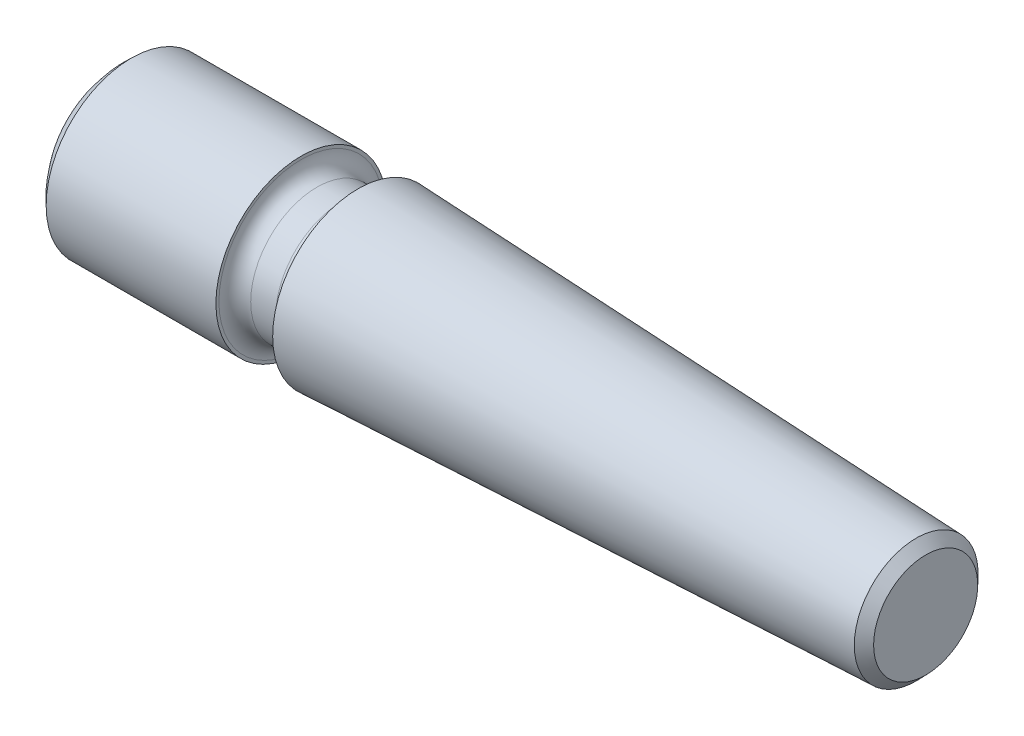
ISO-10303-21;
HEADER;
FILE_DESCRIPTION(('STEP AP214'),'2;1');
FILE_NAME('part.step','',(''),(''),'','','');
FILE_SCHEMA(('AUTOMOTIVE_DESIGN { 1 0 10303 214 1 1 1 1 }'));
ENDSEC;
DATA;
#1=APPLICATION_CONTEXT('core data for automotive mechanical design processes');
#2=APPLICATION_PROTOCOL_DEFINITION('international standard','automotive_design',2000,#1);
#3=PRODUCT_CONTEXT('',#1,'mechanical');
#4=PRODUCT('Part','Part','',(#3));
#5=PRODUCT_RELATED_PRODUCT_CATEGORY('part','',(#4));
#6=PRODUCT_DEFINITION_FORMATION('','',#4);
#7=PRODUCT_DEFINITION_CONTEXT('part definition',#1,'design');
#8=PRODUCT_DEFINITION('design','',#6,#7);
#9=PRODUCT_DEFINITION_SHAPE('','',#8);
#10=(LENGTH_UNIT() NAMED_UNIT(*) SI_UNIT(.MILLI.,.METRE.));
#11=(NAMED_UNIT(*) PLANE_ANGLE_UNIT() SI_UNIT($,.RADIAN.));
#12=(NAMED_UNIT(*) SI_UNIT($,.STERADIAN.) SOLID_ANGLE_UNIT());
#13=UNCERTAINTY_MEASURE_WITH_UNIT(LENGTH_MEASURE(1.E-05),#10,'distance_accuracy_value','');
#14=(GEOMETRIC_REPRESENTATION_CONTEXT(3) GLOBAL_UNCERTAINTY_ASSIGNED_CONTEXT((#13)) GLOBAL_UNIT_ASSIGNED_CONTEXT((#10,
#11,#12)) REPRESENTATION_CONTEXT('',''));
#15=CARTESIAN_POINT('',(0.,0.,0.));
#16=DIRECTION('',(0.,0.,1.));
#17=DIRECTION('',(1.,0.,0.));
#18=AXIS2_PLACEMENT_3D('',#15,#16,#17);
#19=CARTESIAN_POINT('',(-38.,0.,0.));
#20=DIRECTION('',(-1.,0.,0.));
#21=DIRECTION('',(0.,1.,0.));
#22=AXIS2_PLACEMENT_3D('',#19,#20,#21);
#23=SPHERICAL_SURFACE('',#22,6.);
#24=CARTESIAN_POINT('',(-41.9686269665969,0.,0.));
#25=DIRECTION('',(-1.,0.,0.));
#26=DIRECTION('',(0.,0.,1.));
#27=AXIS2_PLACEMENT_3D('',#24,#25,#26);
#28=CIRCLE('',#27,4.49999999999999);
#29=CARTESIAN_POINT('',(-41.9686269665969,0.,4.49999999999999));
#30=VERTEX_POINT('',#29);
#31=EDGE_CURVE('E63',#30,#30,#28,.T.);
#32=ORIENTED_EDGE('',*,*,#31,.T.);
#33=EDGE_LOOP('',(#32));
#34=FACE_BOUND('',#33,.T.);
#35=ADVANCED_FACE('F32',(#34),#23,.T.);
#36=CARTESIAN_POINT('',(0.,0.,0.));
#37=DIRECTION('',(-1.,0.,0.));
#38=DIRECTION('',(0.,0.,1.));
#39=AXIS2_PLACEMENT_3D('',#36,#37,#38);
#40=PLANE('',#39);
#41=CARTESIAN_POINT('',(0.,0.,0.));
#42=DIRECTION('',(-1.,0.,0.));
#43=DIRECTION('',(0.,0.,1.));
#44=AXIS2_PLACEMENT_3D('',#41,#42,#43);
#45=CIRCLE('',#44,2.75);
#46=CARTESIAN_POINT('',(0.,0.,2.75));
#47=VERTEX_POINT('',#46);
#48=EDGE_CURVE('E10',#47,#47,#45,.T.);
#49=ORIENTED_EDGE('',*,*,#48,.F.);
#50=EDGE_LOOP('',(#49));
#51=FACE_BOUND('',#50,.T.);
#52=ADVANCED_FACE('F111',(#51),#40,.F.);
#53=CARTESIAN_POINT('',(0.,0.,0.));
#54=DIRECTION('',(-1.,0.,0.));
#55=DIRECTION('',(0.,0.,1.));
#56=AXIS2_PLACEMENT_3D('',#53,#54,#55);
#57=CONICAL_SURFACE('',#56,2.75,0.806219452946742);
#58=CARTESIAN_POINT('',(-0.499566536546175,0.,0.));
#59=DIRECTION('',(-1.,0.,0.));
#60=DIRECTION('',(0.,0.,1.));
#61=AXIS2_PLACEMENT_3D('',#58,#59,#60);
#62=CIRCLE('',#61,3.27081527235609);
#63=CARTESIAN_POINT('',(-0.499566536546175,0.,3.27081527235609));
#64=VERTEX_POINT('',#63);
#65=EDGE_CURVE('E38',#64,#64,#62,.T.);
#66=ORIENTED_EDGE('',*,*,#65,.F.);
#67=EDGE_LOOP('',(#66));
#68=FACE_BOUND('',#67,.T.);
#69=ORIENTED_EDGE('',*,*,#48,.T.);
#70=EDGE_LOOP('',(#69));
#71=FACE_BOUND('',#70,.T.);
#72=ADVANCED_FACE('F106',(#68,#71),#57,.T.);
#73=CARTESIAN_POINT('',(-0.499566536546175,0.,0.));
#74=DIRECTION('',(-1.,0.,0.));
#75=DIRECTION('',(0.,0.,1.));
#76=AXIS2_PLACEMENT_3D('',#73,#74,#75);
#77=CONICAL_SURFACE('',#76,3.27081527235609,0.0416425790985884);
#78=CARTESIAN_POINT('',(-30.,0.,0.));
#79=DIRECTION('',(-1.,0.,0.));
#80=DIRECTION('',(0.,0.,1.));
#81=AXIS2_PLACEMENT_3D('',#78,#79,#80);
#82=CIRCLE('',#81,4.5);
#83=CARTESIAN_POINT('',(-30.,0.,4.5));
#84=VERTEX_POINT('',#83);
#85=EDGE_CURVE('E42',#84,#84,#82,.T.);
#86=ORIENTED_EDGE('',*,*,#85,.F.);
#87=EDGE_LOOP('',(#86));
#88=FACE_BOUND('',#87,.T.);
#89=ORIENTED_EDGE('',*,*,#65,.T.);
#90=EDGE_LOOP('',(#89));
#91=FACE_BOUND('',#90,.T.);
#92=ADVANCED_FACE('F101',(#88,#91),#77,.T.);
#93=CARTESIAN_POINT('',(-30.,4.34,0.));
#94=DIRECTION('',(1.,0.,0.));
#95=DIRECTION('',(0.,0.,-1.));
#96=AXIS2_PLACEMENT_3D('',#93,#94,#95);
#97=PLANE('',#96);
#98=CARTESIAN_POINT('',(-30.,0.,0.));
#99=DIRECTION('',(-1.,0.,0.));
#100=DIRECTION('',(0.,0.,1.));
#101=AXIS2_PLACEMENT_3D('',#98,#99,#100);
#102=CIRCLE('',#101,4.34);
#103=CARTESIAN_POINT('',(-30.,0.,4.34));
#104=VERTEX_POINT('',#103);
#105=EDGE_CURVE('E46',#104,#104,#102,.T.);
#106=ORIENTED_EDGE('',*,*,#105,.F.);
#107=EDGE_LOOP('',(#106));
#108=FACE_BOUND('',#107,.T.);
#109=ORIENTED_EDGE('',*,*,#85,.T.);
#110=EDGE_LOOP('',(#109));
#111=FACE_BOUND('',#110,.T.);
#112=ADVANCED_FACE('F95',(#108,#111),#97,.F.);
#113=CARTESIAN_POINT('',(-30.84,0.,0.));
#114=DIRECTION('',(-1.,0.,0.));
#115=DIRECTION('',(0.,0.,1.));
#116=AXIS2_PLACEMENT_3D('',#113,#114,#115);
#117=TOROIDAL_SURFACE('',#116,4.34,0.84);
#118=CARTESIAN_POINT('',(-30.84,0.,0.));
#119=DIRECTION('',(-1.,0.,0.));
#120=DIRECTION('',(0.,0.,1.));
#121=AXIS2_PLACEMENT_3D('',#118,#119,#120);
#122=CIRCLE('',#121,3.5);
#123=CARTESIAN_POINT('',(-30.84,0.,3.5));
#124=VERTEX_POINT('',#123);
#125=EDGE_CURVE('E51',#124,#124,#122,.T.);
#126=ORIENTED_EDGE('',*,*,#125,.F.);
#127=EDGE_LOOP('',(#126));
#128=FACE_BOUND('',#127,.T.);
#129=ORIENTED_EDGE('',*,*,#105,.T.);
#130=EDGE_LOOP('',(#129));
#131=FACE_BOUND('',#130,.T.);
#132=ADVANCED_FACE('F89',(#128,#131),#117,.F.);
#133=CARTESIAN_POINT('',(-44.,0.,0.));
#134=DIRECTION('',(-1.,0.,0.));
#135=DIRECTION('',(0.,0.,1.));
#136=AXIS2_PLACEMENT_3D('',#133,#134,#135);
#137=CYLINDRICAL_SURFACE('',#136,3.5);
#138=CARTESIAN_POINT('',(-32.16,0.,0.));
#139=DIRECTION('',(-1.,0.,0.));
#140=DIRECTION('',(0.,0.,1.));
#141=AXIS2_PLACEMENT_3D('',#138,#139,#140);
#142=CIRCLE('',#141,3.5);
#143=CARTESIAN_POINT('',(-32.16,0.,3.5));
#144=VERTEX_POINT('',#143);
#145=EDGE_CURVE('E54',#144,#144,#142,.T.);
#146=ORIENTED_EDGE('',*,*,#145,.F.);
#147=EDGE_LOOP('',(#146));
#148=FACE_BOUND('',#147,.T.);
#149=ORIENTED_EDGE('',*,*,#125,.T.);
#150=EDGE_LOOP('',(#149));
#151=FACE_BOUND('',#150,.T.);
#152=ADVANCED_FACE('F83',(#148,#151),#137,.T.);
#153=CARTESIAN_POINT('',(-32.16,0.,0.));
#154=DIRECTION('',(-1.,0.,0.));
#155=DIRECTION('',(0.,0.,1.));
#156=AXIS2_PLACEMENT_3D('',#153,#154,#155);
#157=TOROIDAL_SURFACE('',#156,4.34,0.84);
#158=CARTESIAN_POINT('',(-33.,0.,0.));
#159=DIRECTION('',(-1.,0.,0.));
#160=DIRECTION('',(0.,0.,1.));
#161=AXIS2_PLACEMENT_3D('',#158,#159,#160);
#162=CIRCLE('',#161,4.34);
#163=CARTESIAN_POINT('',(-33.,0.,4.34));
#164=VERTEX_POINT('',#163);
#165=EDGE_CURVE('E57',#164,#164,#162,.T.);
#166=ORIENTED_EDGE('',*,*,#165,.F.);
#167=EDGE_LOOP('',(#166));
#168=FACE_BOUND('',#167,.T.);
#169=ORIENTED_EDGE('',*,*,#145,.T.);
#170=EDGE_LOOP('',(#169));
#171=FACE_BOUND('',#170,.T.);
#172=ADVANCED_FACE('F77',(#168,#171),#157,.F.);
#173=CARTESIAN_POINT('',(-33.,4.5,0.));
#174=DIRECTION('',(-1.,0.,0.));
#175=DIRECTION('',(0.,0.,1.));
#176=AXIS2_PLACEMENT_3D('',#173,#174,#175);
#177=PLANE('',#176);
#178=CARTESIAN_POINT('',(-33.,0.,0.));
#179=DIRECTION('',(-1.,0.,0.));
#180=DIRECTION('',(0.,0.,1.));
#181=AXIS2_PLACEMENT_3D('',#178,#179,#180);
#182=CIRCLE('',#181,4.5);
#183=CARTESIAN_POINT('',(-33.,0.,4.5));
#184=VERTEX_POINT('',#183);
#185=EDGE_CURVE('E60',#184,#184,#182,.T.);
#186=ORIENTED_EDGE('',*,*,#185,.F.);
#187=EDGE_LOOP('',(#186));
#188=FACE_BOUND('',#187,.T.);
#189=ORIENTED_EDGE('',*,*,#165,.T.);
#190=EDGE_LOOP('',(#189));
#191=FACE_BOUND('',#190,.T.);
#192=ADVANCED_FACE('F71',(#188,#191),#177,.F.);
#193=CARTESIAN_POINT('',(-44.,0.,0.));
#194=DIRECTION('',(-1.,0.,0.));
#195=DIRECTION('',(0.,0.,1.));
#196=AXIS2_PLACEMENT_3D('',#193,#194,#195);
#197=CYLINDRICAL_SURFACE('',#196,4.5);
#198=ORIENTED_EDGE('',*,*,#31,.F.);
#199=EDGE_LOOP('',(#198));
#200=FACE_BOUND('',#199,.T.);
#201=ORIENTED_EDGE('',*,*,#185,.T.);
#202=EDGE_LOOP('',(#201));
#203=FACE_BOUND('',#202,.T.);
#204=ADVANCED_FACE('F68',(#200,#203),#197,.T.);
#205=CLOSED_SHELL('',(#35,#52,#72,#92,#112,#132,#152,#172,#192,#204));
#206=MANIFOLD_SOLID_BREP('B2',#205);
#207=ADVANCED_BREP_SHAPE_REPRESENTATION('',(#18,#206),#14);
#208=SHAPE_DEFINITION_REPRESENTATION(#9,#207);
ENDSEC;
END-ISO-10303-21;
